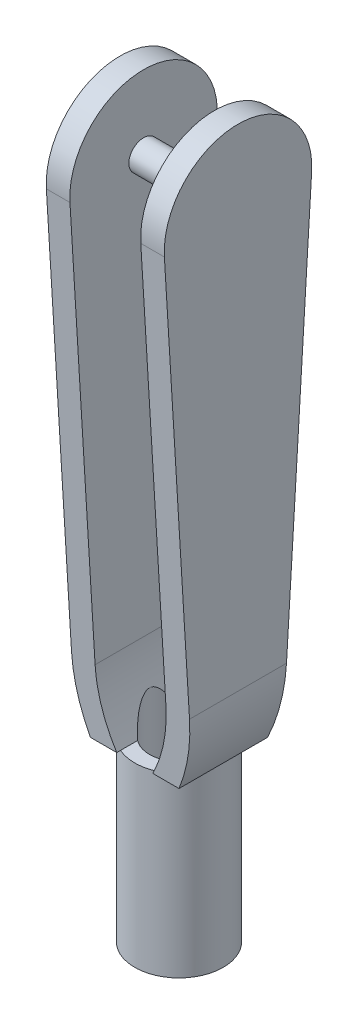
ISO-10303-21;
HEADER;
FILE_DESCRIPTION(('STEP AP214'),'2;1');
FILE_NAME('part.step','',(''),(''),'','','');
FILE_SCHEMA(('AUTOMOTIVE_DESIGN { 1 0 10303 214 1 1 1 1 }'));
ENDSEC;
DATA;
#1=APPLICATION_CONTEXT('core data for automotive mechanical design processes');
#2=APPLICATION_PROTOCOL_DEFINITION('international standard','automotive_design',2000,#1);
#3=PRODUCT_CONTEXT('',#1,'mechanical');
#4=PRODUCT('Part','Part','',(#3));
#5=PRODUCT_RELATED_PRODUCT_CATEGORY('part','',(#4));
#6=PRODUCT_DEFINITION_FORMATION('','',#4);
#7=PRODUCT_DEFINITION_CONTEXT('part definition',#1,'design');
#8=PRODUCT_DEFINITION('design','',#6,#7);
#9=PRODUCT_DEFINITION_SHAPE('','',#8);
#10=(LENGTH_UNIT() NAMED_UNIT(*) SI_UNIT(.MILLI.,.METRE.));
#11=(NAMED_UNIT(*) PLANE_ANGLE_UNIT() SI_UNIT($,.RADIAN.));
#12=(NAMED_UNIT(*) SI_UNIT($,.STERADIAN.) SOLID_ANGLE_UNIT());
#13=UNCERTAINTY_MEASURE_WITH_UNIT(LENGTH_MEASURE(1.E-05),#10,'distance_accuracy_value','');
#14=(GEOMETRIC_REPRESENTATION_CONTEXT(3) GLOBAL_UNCERTAINTY_ASSIGNED_CONTEXT((#13)) GLOBAL_UNIT_ASSIGNED_CONTEXT((#10,
#11,#12)) REPRESENTATION_CONTEXT('',''));
#15=CARTESIAN_POINT('',(0.,0.,0.));
#16=DIRECTION('',(0.,0.,1.));
#17=DIRECTION('',(1.,0.,0.));
#18=AXIS2_PLACEMENT_3D('',#15,#16,#17);
#19=CARTESIAN_POINT('',(0.,0.,3.));
#20=DIRECTION('',(0.,-1.,0.));
#21=DIRECTION('',(0.,0.,-1.));
#22=AXIS2_PLACEMENT_3D('',#19,#20,#21);
#23=PLANE('',#22);
#24=DIRECTION('',(0.,0.,1.));
#25=VECTOR('',#24,1.);
#26=CARTESIAN_POINT('',(0.610215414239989,0.,0.));
#27=LINE('',#26,#25);
#28=CARTESIAN_POINT('',(0.610215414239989,0.,3.7922355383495));
#29=VERTEX_POINT('',#28);
#30=CARTESIAN_POINT('',(0.61021541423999,0.,4.37026900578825));
#31=VERTEX_POINT('',#30);
#32=EDGE_CURVE('E306',#29,#31,#27,.T.);
#33=ORIENTED_EDGE('',*,*,#32,.F.);
#34=CARTESIAN_POINT('',(0.,0.,3.));
#35=DIRECTION('',(0.,-1.,0.));
#36=DIRECTION('',(0.,0.,-1.));
#37=AXIS2_PLACEMENT_3D('',#34,#35,#36);
#38=CIRCLE('',#37,1.);
#39=CARTESIAN_POINT('',(-0.610215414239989,0.,3.7922355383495));
#40=VERTEX_POINT('',#39);
#41=EDGE_CURVE('E167',#29,#40,#38,.T.);
#42=ORIENTED_EDGE('',*,*,#41,.T.);
#43=DIRECTION('',(0.,0.,1.));
#44=VECTOR('',#43,1.);
#45=CARTESIAN_POINT('',(-0.610215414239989,0.,0.));
#46=LINE('',#45,#44);
#47=CARTESIAN_POINT('',(-0.610215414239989,0.,4.37026900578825));
#48=VERTEX_POINT('',#47);
#49=EDGE_CURVE('E176',#40,#48,#46,.T.);
#50=ORIENTED_EDGE('',*,*,#49,.T.);
#51=CARTESIAN_POINT('',(0.,0.,3.));
#52=DIRECTION('',(0.,-1.,0.));
#53=DIRECTION('',(0.,0.,-1.));
#54=AXIS2_PLACEMENT_3D('',#51,#52,#53);
#55=CIRCLE('',#54,1.5);
#56=EDGE_CURVE('E540',#31,#48,#55,.T.);
#57=ORIENTED_EDGE('',*,*,#56,.F.);
#58=EDGE_LOOP('',(#33,#42,#50,#57));
#59=FACE_BOUND('',#58,.T.);
#60=ADVANCED_FACE('F36',(#59),#23,.F.);
#61=CARTESIAN_POINT('',(-1.5,0.,6.));
#62=DIRECTION('',(0.,1.,0.));
#63=DIRECTION('',(0.,0.,1.));
#64=AXIS2_PLACEMENT_3D('',#61,#62,#63);
#65=PLANE('',#64);
#66=CARTESIAN_POINT('',(0.610215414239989,0.,1.62973099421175));
#67=VERTEX_POINT('',#66);
#68=CARTESIAN_POINT('',(1.5,0.,3.));
#69=VERTEX_POINT('',#68);
#70=EDGE_CURVE('E307',#67,#69,#55,.T.);
#71=ORIENTED_EDGE('',*,*,#70,.F.);
#72=CARTESIAN_POINT('',(0.610215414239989,0.,1.5));
#73=VERTEX_POINT('',#72);
#74=EDGE_CURVE('E311',#73,#67,#27,.T.);
#75=ORIENTED_EDGE('',*,*,#74,.F.);
#76=DIRECTION('',(1.,0.,0.));
#77=VECTOR('',#76,1.);
#78=CARTESIAN_POINT('',(-2.,0.,1.5));
#79=LINE('',#78,#77);
#80=CARTESIAN_POINT('',(1.5,0.,1.5));
#81=VERTEX_POINT('',#80);
#82=EDGE_CURVE('E553',#73,#81,#79,.T.);
#83=ORIENTED_EDGE('',*,*,#82,.T.);
#84=DIRECTION('',(0.,0.,-1.));
#85=VECTOR('',#84,1.);
#86=CARTESIAN_POINT('',(1.5,0.,6.));
#87=LINE('',#86,#85);
#88=EDGE_CURVE('E504',#69,#81,#87,.T.);
#89=ORIENTED_EDGE('',*,*,#88,.F.);
#90=EDGE_LOOP('',(#71,#75,#83,#89));
#91=FACE_BOUND('',#90,.T.);
#92=ADVANCED_FACE('F38',(#91),#65,.F.);
#93=EDGE_CURVE('E47',#69,#31,#55,.T.);
#94=ORIENTED_EDGE('',*,*,#93,.F.);
#95=CARTESIAN_POINT('',(1.5,0.,4.5));
#96=VERTEX_POINT('',#95);
#97=EDGE_CURVE('E502',#96,#69,#87,.T.);
#98=ORIENTED_EDGE('',*,*,#97,.F.);
#99=DIRECTION('',(1.,0.,0.));
#100=VECTOR('',#99,1.);
#101=CARTESIAN_POINT('',(-2.,0.,4.5));
#102=LINE('',#101,#100);
#103=CARTESIAN_POINT('',(0.610215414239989,0.,4.5));
#104=VERTEX_POINT('',#103);
#105=EDGE_CURVE('E541',#104,#96,#102,.T.);
#106=ORIENTED_EDGE('',*,*,#105,.F.);
#107=EDGE_CURVE('E310',#31,#104,#27,.T.);
#108=ORIENTED_EDGE('',*,*,#107,.F.);
#109=EDGE_LOOP('',(#94,#98,#106,#108));
#110=FACE_BOUND('',#109,.T.);
#111=ADVANCED_FACE('F248',(#110),#65,.F.);
#112=CARTESIAN_POINT('',(-1.5,0.,6.));
#113=DIRECTION('',(0.,1.,0.));
#114=DIRECTION('',(0.,0.,1.));
#115=AXIS2_PLACEMENT_3D('',#112,#113,#114);
#116=PLANE('',#115);
#117=CARTESIAN_POINT('',(-1.5,0.,3.));
#118=VERTEX_POINT('',#117);
#119=EDGE_CURVE('E11',#48,#118,#55,.T.);
#120=ORIENTED_EDGE('',*,*,#119,.F.);
#121=CARTESIAN_POINT('',(-0.610215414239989,0.,4.5));
#122=VERTEX_POINT('',#121);
#123=EDGE_CURVE('E184',#48,#122,#46,.T.);
#124=ORIENTED_EDGE('',*,*,#123,.T.);
#125=DIRECTION('',(1.,0.,0.));
#126=VECTOR('',#125,1.);
#127=CARTESIAN_POINT('',(-2.,0.,4.5));
#128=LINE('',#127,#126);
#129=CARTESIAN_POINT('',(-1.5,0.,4.5));
#130=VERTEX_POINT('',#129);
#131=EDGE_CURVE('E321',#130,#122,#128,.T.);
#132=ORIENTED_EDGE('',*,*,#131,.F.);
#133=DIRECTION('',(0.,0.,-1.));
#134=VECTOR('',#133,1.);
#135=CARTESIAN_POINT('',(-1.5,0.,6.));
#136=LINE('',#135,#134);
#137=EDGE_CURVE('E203',#130,#118,#136,.T.);
#138=ORIENTED_EDGE('',*,*,#137,.T.);
#139=EDGE_LOOP('',(#120,#124,#132,#138));
#140=FACE_BOUND('',#139,.T.);
#141=ADVANCED_FACE('F279',(#140),#116,.F.);
#142=CARTESIAN_POINT('',(-0.610215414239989,0.,1.62973099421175));
#143=VERTEX_POINT('',#142);
#144=EDGE_CURVE('E45',#118,#143,#55,.T.);
#145=ORIENTED_EDGE('',*,*,#144,.F.);
#146=CARTESIAN_POINT('',(-1.5,0.,1.5));
#147=VERTEX_POINT('',#146);
#148=EDGE_CURVE('E185',#118,#147,#136,.T.);
#149=ORIENTED_EDGE('',*,*,#148,.T.);
#150=DIRECTION('',(1.,0.,0.));
#151=VECTOR('',#150,1.);
#152=CARTESIAN_POINT('',(-2.,0.,1.5));
#153=LINE('',#152,#151);
#154=CARTESIAN_POINT('',(-0.610215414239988,0.,1.5));
#155=VERTEX_POINT('',#154);
#156=EDGE_CURVE('E219',#147,#155,#153,.T.);
#157=ORIENTED_EDGE('',*,*,#156,.T.);
#158=EDGE_CURVE('E182',#155,#143,#46,.T.);
#159=ORIENTED_EDGE('',*,*,#158,.T.);
#160=EDGE_LOOP('',(#145,#149,#157,#159));
#161=FACE_BOUND('',#160,.T.);
#162=ADVANCED_FACE('F218',(#161),#116,.F.);
#163=CARTESIAN_POINT('',(1.2,2.35584379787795,0.));
#164=DIRECTION('',(1.,0.,0.));
#165=DIRECTION('',(0.,1.,0.));
#166=AXIS2_PLACEMENT_3D('',#163,#164,#165);
#167=PLANE('',#166);
#168=CARTESIAN_POINT('',(1.2,16.5,3.));
#169=DIRECTION('',(1.,0.,0.));
#170=DIRECTION('',(0.,1.,0.));
#171=AXIS2_PLACEMENT_3D('',#168,#169,#170);
#172=CIRCLE('',#171,2.5);
#173=CARTESIAN_POINT('',(1.2,16.3480647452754,5.49537886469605));
#174=VERTEX_POINT('',#173);
#175=CARTESIAN_POINT('',(1.2,16.3480647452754,0.504621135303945));
#176=VERTEX_POINT('',#175);
#177=EDGE_CURVE('E534',#174,#176,#172,.F.);
#178=ORIENTED_EDGE('',*,*,#177,.T.);
#179=DIRECTION('',(0.,-0.998151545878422,0.0607741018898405));
#180=VECTOR('',#179,1.);
#181=CARTESIAN_POINT('',(1.2,2.43813515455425,1.35155012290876));
#182=LINE('',#181,#180);
#183=CARTESIAN_POINT('',(1.2,2.35584379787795,1.35656056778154));
#184=VERTEX_POINT('',#183);
#185=EDGE_CURVE('E529',#176,#184,#182,.T.);
#186=ORIENTED_EDGE('',*,*,#185,.T.);
#187=DIRECTION('',(0.,0.,1.));
#188=VECTOR('',#187,1.);
#189=CARTESIAN_POINT('',(1.2,2.35584379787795,0.));
#190=LINE('',#189,#188);
#191=CARTESIAN_POINT('',(1.2,2.35584379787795,4.64343943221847));
#192=VERTEX_POINT('',#191);
#193=EDGE_CURVE('E522',#184,#192,#190,.T.);
#194=ORIENTED_EDGE('',*,*,#193,.T.);
#195=DIRECTION('',(0.,0.998151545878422,0.0607741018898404));
#196=VECTOR('',#195,1.);
#197=CARTESIAN_POINT('',(1.2,2.07416457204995,4.62628892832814));
#198=LINE('',#197,#196);
#199=EDGE_CURVE('E551',#192,#174,#198,.T.);
#200=ORIENTED_EDGE('',*,*,#199,.T.);
#201=EDGE_LOOP('',(#178,#186,#194,#200));
#202=FACE_BOUND('',#201,.T.);
#203=CARTESIAN_POINT('',(1.2,16.5,3.));
#204=DIRECTION('',(1.,0.,0.));
#205=DIRECTION('',(0.,1.,0.));
#206=AXIS2_PLACEMENT_3D('',#203,#204,#205);
#207=CIRCLE('',#206,0.500000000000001);
#208=CARTESIAN_POINT('',(1.2,17.,3.));
#209=VERTEX_POINT('',#208);
#210=EDGE_CURVE('E40',#209,#209,#207,.F.);
#211=ORIENTED_EDGE('',*,*,#210,.F.);
#212=EDGE_LOOP('',(#211));
#213=FACE_BOUND('',#212,.T.);
#214=ADVANCED_FACE('F342',(#202,#213),#167,.F.);
#215=CARTESIAN_POINT('',(-3.8,2.35584379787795,6.));
#216=DIRECTION('',(0.,0.,-1.));
#217=DIRECTION('',(-1.,0.,0.));
#218=AXIS2_PLACEMENT_3D('',#215,#216,#217);
#219=CYLINDRICAL_SURFACE('',#218,5.8);
#220=ORIENTED_EDGE('',*,*,#97,.T.);
#221=ORIENTED_EDGE('',*,*,#88,.T.);
#222=CARTESIAN_POINT('',(-3.8,2.35584379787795,1.35656056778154));
#223=DIRECTION('',(0.,0.0607741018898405,0.998151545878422));
#224=DIRECTION('',(0.,0.998151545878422,-0.0607741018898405));
#225=AXIS2_PLACEMENT_3D('',#222,#223,#224);
#226=ELLIPSE('',#225,5.81074088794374,5.8);
#227=CARTESIAN_POINT('',(2.,2.35584379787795,1.35656056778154));
#228=VERTEX_POINT('',#227);
#229=EDGE_CURVE('E526',#81,#228,#226,.T.);
#230=ORIENTED_EDGE('',*,*,#229,.T.);
#231=DIRECTION('',(0.,0.,-1.));
#232=VECTOR('',#231,1.);
#233=CARTESIAN_POINT('',(2.,2.35584379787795,6.));
#234=LINE('',#233,#232);
#235=CARTESIAN_POINT('',(2.,2.35584379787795,4.64343943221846));
#236=VERTEX_POINT('',#235);
#237=EDGE_CURVE('E519',#236,#228,#234,.T.);
#238=ORIENTED_EDGE('',*,*,#237,.F.);
#239=CARTESIAN_POINT('',(-3.8,2.35584379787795,4.64343943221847));
#240=DIRECTION('',(0.,0.0607741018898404,-0.998151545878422));
#241=DIRECTION('',(0.,-0.998151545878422,-0.0607741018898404));
#242=AXIS2_PLACEMENT_3D('',#239,#240,#241);
#243=ELLIPSE('',#242,5.81074088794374,5.8);
#244=EDGE_CURVE('E507',#236,#96,#243,.T.);
#245=ORIENTED_EDGE('',*,*,#244,.T.);
#246=EDGE_LOOP('',(#220,#221,#230,#238,#245));
#247=FACE_BOUND('',#246,.T.);
#248=ADVANCED_FACE('F399',(#247),#219,.T.);
#249=CARTESIAN_POINT('',(2.,2.35584379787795,6.));
#250=DIRECTION('',(-1.,0.,0.));
#251=DIRECTION('',(0.,0.,1.));
#252=AXIS2_PLACEMENT_3D('',#249,#250,#251);
#253=PLANE('',#252);
#254=ORIENTED_EDGE('',*,*,#237,.T.);
#255=DIRECTION('',(0.,-0.998151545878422,0.0607741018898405));
#256=VECTOR('',#255,1.);
#257=CARTESIAN_POINT('',(2.,0.,1.5));
#258=LINE('',#257,#256);
#259=CARTESIAN_POINT('',(2.,16.3480647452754,0.504621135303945));
#260=VERTEX_POINT('',#259);
#261=EDGE_CURVE('E543',#260,#228,#258,.T.);
#262=ORIENTED_EDGE('',*,*,#261,.F.);
#263=CARTESIAN_POINT('',(2.,16.5,3.));
#264=DIRECTION('',(-1.,0.,0.));
#265=DIRECTION('',(0.,0.,-1.));
#266=AXIS2_PLACEMENT_3D('',#263,#264,#265);
#267=CIRCLE('',#266,2.5);
#268=CARTESIAN_POINT('',(2.,16.3480647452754,5.49537886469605));
#269=VERTEX_POINT('',#268);
#270=EDGE_CURVE('E547',#269,#260,#267,.T.);
#271=ORIENTED_EDGE('',*,*,#270,.F.);
#272=DIRECTION('',(0.,0.998151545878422,0.0607741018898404));
#273=VECTOR('',#272,1.);
#274=CARTESIAN_POINT('',(2.,0.,4.5));
#275=LINE('',#274,#273);
#276=EDGE_CURVE('E560',#236,#269,#275,.T.);
#277=ORIENTED_EDGE('',*,*,#276,.F.);
#278=EDGE_LOOP('',(#254,#262,#271,#277));
#279=FACE_BOUND('',#278,.T.);
#280=ADVANCED_FACE('F437',(#279),#253,.F.);
#281=CARTESIAN_POINT('',(-3.8,2.35584379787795,0.));
#282=DIRECTION('',(0.,0.,1.));
#283=DIRECTION('',(1.,0.,0.));
#284=AXIS2_PLACEMENT_3D('',#281,#282,#283);
#285=CYLINDRICAL_SURFACE('',#284,5.);
#286=CARTESIAN_POINT('',(0.610215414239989,0.,2.2077644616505));
#287=VERTEX_POINT('',#286);
#288=EDGE_CURVE('E308',#67,#287,#27,.T.);
#289=ORIENTED_EDGE('',*,*,#288,.T.);
#290=CARTESIAN_POINT('',(0.610215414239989,0.,2.2077644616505));
#291=CARTESIAN_POINT('',(0.636707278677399,0.0495840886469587,2.22819975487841));
#292=CARTESIAN_POINT('',(0.662143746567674,0.0992239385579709,2.24988231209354));
#293=CARTESIAN_POINT('',(0.710955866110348,0.198453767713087,2.29595210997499));
#294=CARTESIAN_POINT('',(0.734325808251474,0.248043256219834,2.32034644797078));
#295=CARTESIAN_POINT('',(0.780078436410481,0.349322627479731,2.37329109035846));
#296=CARTESIAN_POINT('',(0.802345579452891,0.400986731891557,2.40199201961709));
#297=CARTESIAN_POINT('',(0.844389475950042,0.50309127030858,2.4629909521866));
#298=CARTESIAN_POINT('',(0.86416958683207,0.553533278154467,2.49528399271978));
#299=CARTESIAN_POINT('',(0.900802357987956,0.651403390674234,2.56403861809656));
#300=CARTESIAN_POINT('',(0.917697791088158,0.698867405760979,2.60042296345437));
#301=CARTESIAN_POINT('',(0.940611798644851,0.766138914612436,2.65987191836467));
#302=CARTESIAN_POINT('',(0.947810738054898,0.787796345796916,2.68037011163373));
#303=CARTESIAN_POINT('',(0.961276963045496,0.829177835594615,2.72348884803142));
#304=CARTESIAN_POINT('',(0.967546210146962,0.848905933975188,2.74610475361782));
#305=CARTESIAN_POINT('',(0.977044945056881,0.879358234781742,2.78631693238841));
#306=CARTESIAN_POINT('',(0.980602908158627,0.890935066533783,2.80318168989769));
#307=CARTESIAN_POINT('',(0.987005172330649,0.911994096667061,2.83832362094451));
#308=CARTESIAN_POINT('',(0.989849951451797,0.921477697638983,2.85659983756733));
#309=CARTESIAN_POINT('',(0.994233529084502,0.9362047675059,2.89156278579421));
#310=CARTESIAN_POINT('',(0.995907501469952,0.941880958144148,2.90804598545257));
#311=CARTESIAN_POINT('',(0.998445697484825,0.950518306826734,2.94176972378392));
#312=CARTESIAN_POINT('',(0.999311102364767,0.953483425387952,2.95900911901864));
#313=CARTESIAN_POINT('',(1.00013387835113,0.956301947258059,2.99387642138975));
#314=CARTESIAN_POINT('',(1.00008583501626,0.956136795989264,3.01150602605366));
#315=CARTESIAN_POINT('',(0.999074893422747,0.952674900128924,3.04642827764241));
#316=CARTESIAN_POINT('',(0.998111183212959,0.94937537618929,3.06372061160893));
#317=CARTESIAN_POINT('',(0.995091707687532,0.939112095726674,3.10106841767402));
#318=CARTESIAN_POINT('',(0.992847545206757,0.9315191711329,3.1209311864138));
#319=CARTESIAN_POINT('',(0.987442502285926,0.913455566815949,3.15916046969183));
#320=CARTESIAN_POINT('',(0.9842794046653,0.902977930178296,3.17752322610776));
#321=CARTESIAN_POINT('',(0.974359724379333,0.870596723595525,3.2273954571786));
#322=CARTESIAN_POINT('',(0.966793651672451,0.846406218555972,3.25722909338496));
#323=CARTESIAN_POINT('',(0.950100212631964,0.794657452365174,3.31331266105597));
#324=CARTESIAN_POINT('',(0.940966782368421,0.76708623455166,3.33954793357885));
#325=CARTESIAN_POINT('',(0.916261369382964,0.694818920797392,3.40268698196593));
#326=CARTESIAN_POINT('',(0.899858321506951,0.648850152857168,3.43779263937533));
#327=CARTESIAN_POINT('',(0.864634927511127,0.55480861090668,3.5037823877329));
#328=CARTESIAN_POINT('',(0.845809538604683,0.506731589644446,3.53465738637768));
#329=CARTESIAN_POINT('',(0.805897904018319,0.409444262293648,3.59311143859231));
#330=CARTESIAN_POINT('',(0.784808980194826,0.360232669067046,3.62068650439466));
#331=CARTESIAN_POINT('',(0.74045462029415,0.261275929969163,3.67297920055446));
#332=CARTESIAN_POINT('',(0.717188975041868,0.211530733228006,3.6976965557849));
#333=CARTESIAN_POINT('',(0.679675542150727,0.134715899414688,3.73373992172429));
#334=CARTESIAN_POINT('',(0.666186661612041,0.107711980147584,3.74600773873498));
#335=CARTESIAN_POINT('',(0.638639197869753,0.0538023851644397,3.76971964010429));
#336=CARTESIAN_POINT('',(0.624583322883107,0.0268967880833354,3.78116704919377));
#337=CARTESIAN_POINT('',(0.610215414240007,0.,3.79223553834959));
#338=B_SPLINE_CURVE_WITH_KNOTS('',3,(#290,#291,#292,#293,#294,#295,#296,#297,#298,#299,#300,
#301,#302,#303,#304,#305,#306,#307,#308,#309,#310,#311,#312,#313,#314,#315,#316,#317,#318,#319,
#320,#321,#322,#323,#324,#325,#326,#327,#328,#329,#330,#331,#332,#333,#334,#335,#336,#337),
.UNSPECIFIED.,.F.,.F.,(4,2,2,2,2,2,2,2,2,2,2,2,2,2,2,2,2,2,2,2,2,2,2,4),(0.,0.179432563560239,
0.359346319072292,0.548668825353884,0.73773294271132,0.923689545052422,1.01562732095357,
1.10736827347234,1.1695405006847,1.23167094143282,1.28400821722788,1.33626891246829,
1.38883947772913,1.44145670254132,1.50524375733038,1.5691860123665,1.68596896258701,
1.80321436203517,1.98316298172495,2.16349246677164,2.34403771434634,2.52460032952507,
2.62233632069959,2.71965075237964),.UNSPECIFIED.);
#339=EDGE_CURVE('E54',#287,#29,#338,.T.);
#340=ORIENTED_EDGE('',*,*,#339,.T.);
#341=ORIENTED_EDGE('',*,*,#32,.T.);
#342=ORIENTED_EDGE('',*,*,#107,.T.);
#343=CARTESIAN_POINT('',(-3.8,2.35584379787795,4.64343943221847));
#344=DIRECTION('',(0.,0.0607741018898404,-0.998151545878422));
#345=DIRECTION('',(0.,0.998151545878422,0.0607741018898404));
#346=AXIS2_PLACEMENT_3D('',#343,#344,#345);
#347=ELLIPSE('',#346,5.0092593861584,5.);
#348=EDGE_CURVE('E509',#104,#192,#347,.F.);
#349=ORIENTED_EDGE('',*,*,#348,.T.);
#350=ORIENTED_EDGE('',*,*,#193,.F.);
#351=CARTESIAN_POINT('',(-3.8,2.35584379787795,1.35656056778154));
#352=DIRECTION('',(0.,0.0607741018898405,0.998151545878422));
#353=DIRECTION('',(0.,-0.998151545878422,0.0607741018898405));
#354=AXIS2_PLACEMENT_3D('',#351,#352,#353);
#355=ELLIPSE('',#354,5.0092593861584,5.);
#356=EDGE_CURVE('E518',#184,#73,#355,.F.);
#357=ORIENTED_EDGE('',*,*,#356,.T.);
#358=ORIENTED_EDGE('',*,*,#74,.T.);
#359=EDGE_LOOP('',(#289,#340,#341,#342,#349,#350,#357,#358));
#360=FACE_BOUND('',#359,.T.);
#361=ADVANCED_FACE('F429',(#360),#285,.F.);
#362=CARTESIAN_POINT('',(-2.,16.5,3.));
#363=DIRECTION('',(1.,0.,0.));
#364=DIRECTION('',(0.,0.,-1.));
#365=AXIS2_PLACEMENT_3D('',#362,#363,#364);
#366=CYLINDRICAL_SURFACE('',#365,2.5);
#367=DIRECTION('',(1.,0.,0.));
#368=VECTOR('',#367,1.);
#369=CARTESIAN_POINT('',(-2.,16.3480647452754,5.49537886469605));
#370=LINE('',#369,#368);
#371=EDGE_CURVE('E542',#174,#269,#370,.T.);
#372=ORIENTED_EDGE('',*,*,#371,.T.);
#373=ORIENTED_EDGE('',*,*,#270,.T.);
#374=DIRECTION('',(1.,0.,0.));
#375=VECTOR('',#374,1.);
#376=CARTESIAN_POINT('',(-2.,16.3480647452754,0.504621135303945));
#377=LINE('',#376,#375);
#378=EDGE_CURVE('E545',#176,#260,#377,.T.);
#379=ORIENTED_EDGE('',*,*,#378,.F.);
#380=ORIENTED_EDGE('',*,*,#177,.F.);
#381=EDGE_LOOP('',(#372,#373,#379,#380));
#382=FACE_BOUND('',#381,.T.);
#383=ADVANCED_FACE('F419',(#382),#366,.T.);
#384=CARTESIAN_POINT('',(-2.,0.,1.5));
#385=DIRECTION('',(0.,0.0607741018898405,0.998151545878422));
#386=DIRECTION('',(0.,-0.998151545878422,0.0607741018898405));
#387=AXIS2_PLACEMENT_3D('',#384,#385,#386);
#388=PLANE('',#387);
#389=ORIENTED_EDGE('',*,*,#82,.F.);
#390=ORIENTED_EDGE('',*,*,#356,.F.);
#391=ORIENTED_EDGE('',*,*,#185,.F.);
#392=ORIENTED_EDGE('',*,*,#378,.T.);
#393=ORIENTED_EDGE('',*,*,#261,.T.);
#394=ORIENTED_EDGE('',*,*,#229,.F.);
#395=EDGE_LOOP('',(#389,#390,#391,#392,#393,#394));
#396=FACE_BOUND('',#395,.T.);
#397=ADVANCED_FACE('F409',(#396),#388,.F.);
#398=CARTESIAN_POINT('',(-2.,0.,4.5));
#399=DIRECTION('',(0.,0.0607741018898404,-0.998151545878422));
#400=DIRECTION('',(0.,0.998151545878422,0.0607741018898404));
#401=AXIS2_PLACEMENT_3D('',#398,#399,#400);
#402=PLANE('',#401);
#403=ORIENTED_EDGE('',*,*,#276,.T.);
#404=ORIENTED_EDGE('',*,*,#371,.F.);
#405=ORIENTED_EDGE('',*,*,#199,.F.);
#406=ORIENTED_EDGE('',*,*,#348,.F.);
#407=ORIENTED_EDGE('',*,*,#105,.T.);
#408=ORIENTED_EDGE('',*,*,#244,.F.);
#409=EDGE_LOOP('',(#403,#404,#405,#406,#407,#408));
#410=FACE_BOUND('',#409,.T.);
#411=ADVANCED_FACE('F389',(#410),#402,.F.);
#412=CARTESIAN_POINT('',(2.6142135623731,16.5,3.));
#413=DIRECTION('',(-1.,0.,0.));
#414=DIRECTION('',(0.,0.,1.));
#415=AXIS2_PLACEMENT_3D('',#412,#413,#414);
#416=CYLINDRICAL_SURFACE('',#415,0.500000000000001);
#417=CARTESIAN_POINT('',(-1.2,16.5,3.));
#418=DIRECTION('',(-1.,0.,0.));
#419=DIRECTION('',(0.,0.,1.));
#420=AXIS2_PLACEMENT_3D('',#417,#418,#419);
#421=CIRCLE('',#420,0.500000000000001);
#422=CARTESIAN_POINT('',(-1.2,16.5,3.5));
#423=VERTEX_POINT('',#422);
#424=EDGE_CURVE('E568',#423,#423,#421,.T.);
#425=ORIENTED_EDGE('',*,*,#424,.F.);
#426=EDGE_LOOP('',(#425));
#427=FACE_BOUND('',#426,.T.);
#428=ORIENTED_EDGE('',*,*,#210,.T.);
#429=EDGE_LOOP('',(#428));
#430=FACE_BOUND('',#429,.T.);
#431=ADVANCED_FACE('F238',(#427,#430),#416,.T.);
#432=CARTESIAN_POINT('',(-1.2,20.,0.));
#433=DIRECTION('',(-1.,0.,0.));
#434=DIRECTION('',(0.,0.,1.));
#435=AXIS2_PLACEMENT_3D('',#432,#433,#434);
#436=PLANE('',#435);
#437=DIRECTION('',(0.,0.,1.));
#438=VECTOR('',#437,1.);
#439=CARTESIAN_POINT('',(-1.2,2.35584379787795,0.));
#440=LINE('',#439,#438);
#441=CARTESIAN_POINT('',(-1.2,2.35584379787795,1.35656056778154));
#442=VERTEX_POINT('',#441);
#443=CARTESIAN_POINT('',(-1.2,2.35584379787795,4.64343943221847));
#444=VERTEX_POINT('',#443);
#445=EDGE_CURVE('E204',#442,#444,#440,.T.);
#446=ORIENTED_EDGE('',*,*,#445,.F.);
#447=DIRECTION('',(0.,0.998151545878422,-0.0607741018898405));
#448=VECTOR('',#447,1.);
#449=CARTESIAN_POINT('',(-1.2,20.0171228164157,0.281224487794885));
#450=LINE('',#449,#448);
#451=CARTESIAN_POINT('',(-1.2,16.3480647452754,0.504621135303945));
#452=VERTEX_POINT('',#451);
#453=EDGE_CURVE('E335',#442,#452,#450,.T.);
#454=ORIENTED_EDGE('',*,*,#453,.T.);
#455=CARTESIAN_POINT('',(-1.2,16.5,3.));
#456=DIRECTION('',(-1.,0.,0.));
#457=DIRECTION('',(0.,0.,1.));
#458=AXIS2_PLACEMENT_3D('',#455,#456,#457);
#459=CIRCLE('',#458,2.5);
#460=CARTESIAN_POINT('',(-1.2,16.3480647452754,5.49537886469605));
#461=VERTEX_POINT('',#460);
#462=EDGE_CURVE('E211',#452,#461,#459,.F.);
#463=ORIENTED_EDGE('',*,*,#462,.T.);
#464=DIRECTION('',(0.,-0.998151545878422,-0.0607741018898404));
#465=VECTOR('',#464,1.);
#466=CARTESIAN_POINT('',(-1.2,19.6531522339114,5.69661456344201));
#467=LINE('',#466,#465);
#468=EDGE_CURVE('E206',#461,#444,#467,.T.);
#469=ORIENTED_EDGE('',*,*,#468,.T.);
#470=EDGE_LOOP('',(#446,#454,#463,#469));
#471=FACE_BOUND('',#470,.T.);
#472=ORIENTED_EDGE('',*,*,#424,.T.);
#473=EDGE_LOOP('',(#472));
#474=FACE_BOUND('',#473,.T.);
#475=ADVANCED_FACE('F230',(#471,#474),#436,.F.);
#476=CARTESIAN_POINT('',(3.8,2.35584379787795,6.));
#477=DIRECTION('',(0.,0.,-1.));
#478=DIRECTION('',(-1.,0.,0.));
#479=AXIS2_PLACEMENT_3D('',#476,#477,#478);
#480=CYLINDRICAL_SURFACE('',#479,5.8);
#481=DIRECTION('',(0.,0.,-1.));
#482=VECTOR('',#481,1.);
#483=CARTESIAN_POINT('',(-2.,2.35584379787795,6.));
#484=LINE('',#483,#482);
#485=CARTESIAN_POINT('',(-2.,2.35584379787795,4.64343943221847));
#486=VERTEX_POINT('',#485);
#487=CARTESIAN_POINT('',(-2.,2.35584379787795,1.35656056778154));
#488=VERTEX_POINT('',#487);
#489=EDGE_CURVE('E188',#486,#488,#484,.T.);
#490=ORIENTED_EDGE('',*,*,#489,.T.);
#491=CARTESIAN_POINT('',(3.8,2.35584379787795,1.35656056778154));
#492=DIRECTION('',(0.,0.0607741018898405,0.998151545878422));
#493=DIRECTION('',(0.,0.998151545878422,-0.0607741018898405));
#494=AXIS2_PLACEMENT_3D('',#491,#492,#493);
#495=ELLIPSE('',#494,5.81074088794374,5.8);
#496=EDGE_CURVE('E194',#488,#147,#495,.T.);
#497=ORIENTED_EDGE('',*,*,#496,.T.);
#498=ORIENTED_EDGE('',*,*,#148,.F.);
#499=ORIENTED_EDGE('',*,*,#137,.F.);
#500=CARTESIAN_POINT('',(3.8,2.35584379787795,4.64343943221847));
#501=DIRECTION('',(0.,0.0607741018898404,-0.998151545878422));
#502=DIRECTION('',(0.,-0.998151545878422,-0.0607741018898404));
#503=AXIS2_PLACEMENT_3D('',#500,#501,#502);
#504=ELLIPSE('',#503,5.81074088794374,5.8);
#505=EDGE_CURVE('E330',#130,#486,#504,.T.);
#506=ORIENTED_EDGE('',*,*,#505,.T.);
#507=EDGE_LOOP('',(#490,#497,#498,#499,#506));
#508=FACE_BOUND('',#507,.T.);
#509=ADVANCED_FACE('F227',(#508),#480,.T.);
#510=CARTESIAN_POINT('',(-2.,2.35584379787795,6.));
#511=DIRECTION('',(1.,0.,0.));
#512=DIRECTION('',(0.,1.,0.));
#513=AXIS2_PLACEMENT_3D('',#510,#511,#512);
#514=PLANE('',#513);
#515=CARTESIAN_POINT('',(-2.,16.5,3.));
#516=DIRECTION('',(-1.,0.,0.));
#517=DIRECTION('',(0.,0.,-1.));
#518=AXIS2_PLACEMENT_3D('',#515,#516,#517);
#519=CIRCLE('',#518,2.5);
#520=CARTESIAN_POINT('',(-2.,16.3480647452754,5.49537886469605));
#521=VERTEX_POINT('',#520);
#522=CARTESIAN_POINT('',(-2.,16.3480647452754,0.504621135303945));
#523=VERTEX_POINT('',#522);
#524=EDGE_CURVE('E317',#521,#523,#519,.T.);
#525=ORIENTED_EDGE('',*,*,#524,.T.);
#526=DIRECTION('',(0.,-0.998151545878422,0.0607741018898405));
#527=VECTOR('',#526,1.);
#528=CARTESIAN_POINT('',(-2.,0.,1.5));
#529=LINE('',#528,#527);
#530=EDGE_CURVE('E320',#523,#488,#529,.T.);
#531=ORIENTED_EDGE('',*,*,#530,.T.);
#532=ORIENTED_EDGE('',*,*,#489,.F.);
#533=DIRECTION('',(0.,0.998151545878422,0.0607741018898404));
#534=VECTOR('',#533,1.);
#535=CARTESIAN_POINT('',(-2.,0.,4.5));
#536=LINE('',#535,#534);
#537=EDGE_CURVE('E314',#486,#521,#536,.T.);
#538=ORIENTED_EDGE('',*,*,#537,.T.);
#539=EDGE_LOOP('',(#525,#531,#532,#538));
#540=FACE_BOUND('',#539,.T.);
#541=ADVANCED_FACE('F229',(#540),#514,.F.);
#542=CARTESIAN_POINT('',(3.8,2.35584379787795,0.));
#543=DIRECTION('',(0.,0.,1.));
#544=DIRECTION('',(1.,0.,0.));
#545=AXIS2_PLACEMENT_3D('',#542,#543,#544);
#546=CYLINDRICAL_SURFACE('',#545,5.);
#547=ORIENTED_EDGE('',*,*,#49,.F.);
#548=CARTESIAN_POINT('',(-0.610215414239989,0.,3.7922355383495));
#549=CARTESIAN_POINT('',(-0.636707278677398,0.0495840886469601,3.77180024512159));
#550=CARTESIAN_POINT('',(-0.662143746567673,0.0992239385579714,3.75011768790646));
#551=CARTESIAN_POINT('',(-0.710955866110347,0.198453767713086,3.70404789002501));
#552=CARTESIAN_POINT('',(-0.734325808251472,0.248043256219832,3.67965355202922));
#553=CARTESIAN_POINT('',(-0.780078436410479,0.349322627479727,3.62670890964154));
#554=CARTESIAN_POINT('',(-0.802345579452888,0.400986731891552,3.59800798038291));
#555=CARTESIAN_POINT('',(-0.844389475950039,0.503091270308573,3.5370090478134));
#556=CARTESIAN_POINT('',(-0.864169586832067,0.553533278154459,3.50471600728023));
#557=CARTESIAN_POINT('',(-0.900802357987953,0.651403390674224,3.43596138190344));
#558=CARTESIAN_POINT('',(-0.917697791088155,0.698867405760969,3.39957703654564));
#559=CARTESIAN_POINT('',(-0.940611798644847,0.766138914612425,3.34012808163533));
#560=CARTESIAN_POINT('',(-0.947810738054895,0.787796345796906,3.31962988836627));
#561=CARTESIAN_POINT('',(-0.961276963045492,0.829177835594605,3.27651115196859));
#562=CARTESIAN_POINT('',(-0.967546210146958,0.848905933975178,3.25389524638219));
#563=CARTESIAN_POINT('',(-0.977044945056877,0.879358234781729,3.2136830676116));
#564=CARTESIAN_POINT('',(-0.980602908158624,0.890935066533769,3.19681831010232));
#565=CARTESIAN_POINT('',(-0.987005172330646,0.911994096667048,3.1616763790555));
#566=CARTESIAN_POINT('',(-0.989849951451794,0.921477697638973,3.14340016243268));
#567=CARTESIAN_POINT('',(-0.994233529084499,0.936204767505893,3.10843721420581));
#568=CARTESIAN_POINT('',(-0.995907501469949,0.941880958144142,3.09195401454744));
#569=CARTESIAN_POINT('',(-0.998445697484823,0.95051830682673,3.05823027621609));
#570=CARTESIAN_POINT('',(-0.999311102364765,0.95348342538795,3.04099088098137));
#571=CARTESIAN_POINT('',(-1.00013387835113,0.956301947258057,3.00612357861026));
#572=CARTESIAN_POINT('',(-1.00008583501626,0.956136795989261,2.98849397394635));
#573=CARTESIAN_POINT('',(-0.999074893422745,0.952674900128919,2.9535717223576));
#574=CARTESIAN_POINT('',(-0.998111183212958,0.949375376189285,2.93627938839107));
#575=CARTESIAN_POINT('',(-0.995091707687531,0.939112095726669,2.89893158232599));
#576=CARTESIAN_POINT('',(-0.992847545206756,0.931519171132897,2.87906881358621));
#577=CARTESIAN_POINT('',(-0.987442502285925,0.91345556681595,2.84083953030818));
#578=CARTESIAN_POINT('',(-0.9842794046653,0.902977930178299,2.82247677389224));
#579=CARTESIAN_POINT('',(-0.974359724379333,0.87059672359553,2.77260454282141));
#580=CARTESIAN_POINT('',(-0.966793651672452,0.846406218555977,2.74277090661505));
#581=CARTESIAN_POINT('',(-0.950100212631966,0.79465745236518,2.68668733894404));
#582=CARTESIAN_POINT('',(-0.940966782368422,0.767086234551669,2.66045206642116));
#583=CARTESIAN_POINT('',(-0.916261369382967,0.694818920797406,2.59731301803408));
#584=CARTESIAN_POINT('',(-0.899858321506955,0.648850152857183,2.56220736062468));
#585=CARTESIAN_POINT('',(-0.864634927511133,0.554808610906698,2.49621761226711));
#586=CARTESIAN_POINT('',(-0.845809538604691,0.506731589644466,2.46534261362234));
#587=CARTESIAN_POINT('',(-0.805897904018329,0.409444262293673,2.4068885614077));
#588=CARTESIAN_POINT('',(-0.784808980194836,0.360232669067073,2.37931349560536));
#589=CARTESIAN_POINT('',(-0.740454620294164,0.261275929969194,2.32702079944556));
#590=CARTESIAN_POINT('',(-0.717188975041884,0.211530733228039,2.30230344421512));
#591=CARTESIAN_POINT('',(-0.679675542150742,0.134715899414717,2.26626007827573));
#592=CARTESIAN_POINT('',(-0.666186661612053,0.107711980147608,2.25399226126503));
#593=CARTESIAN_POINT('',(-0.638639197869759,0.0538023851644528,2.23028035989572));
#594=CARTESIAN_POINT('',(-0.62458332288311,0.026896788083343,2.21883295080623));
#595=CARTESIAN_POINT('',(-0.610215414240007,0.,2.20776446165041));
#596=B_SPLINE_CURVE_WITH_KNOTS('',3,(#548,#549,#550,#551,#552,#553,#554,#555,#556,#557,#558,
#559,#560,#561,#562,#563,#564,#565,#566,#567,#568,#569,#570,#571,#572,#573,#574,#575,#576,#577,
#578,#579,#580,#581,#582,#583,#584,#585,#586,#587,#588,#589,#590,#591,#592,#593,#594,#595),
.UNSPECIFIED.,.F.,.F.,(4,2,2,2,2,2,2,2,2,2,2,2,2,2,2,2,2,2,2,2,2,2,2,4),(0.,0.179432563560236,
0.359346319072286,0.548668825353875,0.737732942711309,0.923689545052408,1.01562732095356,
1.10736827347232,1.16954050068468,1.2316709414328,1.28400821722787,1.33626891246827,
1.38883947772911,1.44145670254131,1.50524375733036,1.56918601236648,1.68596896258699,
1.80321436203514,1.98316298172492,2.1634924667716,2.3440377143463,2.52460032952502,
2.62233632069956,2.71965075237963),.UNSPECIFIED.);
#597=CARTESIAN_POINT('',(-0.610215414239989,0.,2.2077644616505));
#598=VERTEX_POINT('',#597);
#599=EDGE_CURVE('E159',#40,#598,#596,.T.);
#600=ORIENTED_EDGE('',*,*,#599,.T.);
#601=EDGE_CURVE('E173',#143,#598,#46,.T.);
#602=ORIENTED_EDGE('',*,*,#601,.F.);
#603=ORIENTED_EDGE('',*,*,#158,.F.);
#604=CARTESIAN_POINT('',(3.8,2.35584379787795,1.35656056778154));
#605=DIRECTION('',(0.,0.0607741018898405,0.998151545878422));
#606=DIRECTION('',(0.,-0.998151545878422,0.0607741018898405));
#607=AXIS2_PLACEMENT_3D('',#604,#605,#606);
#608=ELLIPSE('',#607,5.0092593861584,5.);
#609=EDGE_CURVE('E200',#155,#442,#608,.F.);
#610=ORIENTED_EDGE('',*,*,#609,.T.);
#611=ORIENTED_EDGE('',*,*,#445,.T.);
#612=CARTESIAN_POINT('',(3.8,2.35584379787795,4.64343943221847));
#613=DIRECTION('',(0.,0.0607741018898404,-0.998151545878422));
#614=DIRECTION('',(0.,0.998151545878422,0.0607741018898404));
#615=AXIS2_PLACEMENT_3D('',#612,#613,#614);
#616=ELLIPSE('',#615,5.0092593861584,5.);
#617=EDGE_CURVE('E224',#444,#122,#616,.F.);
#618=ORIENTED_EDGE('',*,*,#617,.T.);
#619=ORIENTED_EDGE('',*,*,#123,.F.);
#620=EDGE_LOOP('',(#547,#600,#602,#603,#610,#611,#618,#619));
#621=FACE_BOUND('',#620,.T.);
#622=ADVANCED_FACE('F171',(#621),#546,.F.);
#623=CARTESIAN_POINT('',(-2.,0.,1.5));
#624=DIRECTION('',(0.,0.0607741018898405,0.998151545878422));
#625=DIRECTION('',(0.,-0.998151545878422,0.0607741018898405));
#626=AXIS2_PLACEMENT_3D('',#623,#624,#625);
#627=PLANE('',#626);
#628=ORIENTED_EDGE('',*,*,#530,.F.);
#629=DIRECTION('',(1.,0.,0.));
#630=VECTOR('',#629,1.);
#631=CARTESIAN_POINT('',(-2.,16.3480647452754,0.504621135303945));
#632=LINE('',#631,#630);
#633=EDGE_CURVE('E225',#523,#452,#632,.T.);
#634=ORIENTED_EDGE('',*,*,#633,.T.);
#635=ORIENTED_EDGE('',*,*,#453,.F.);
#636=ORIENTED_EDGE('',*,*,#609,.F.);
#637=ORIENTED_EDGE('',*,*,#156,.F.);
#638=ORIENTED_EDGE('',*,*,#496,.F.);
#639=EDGE_LOOP('',(#628,#634,#635,#636,#637,#638));
#640=FACE_BOUND('',#639,.T.);
#641=ADVANCED_FACE('F222',(#640),#627,.F.);
#642=CARTESIAN_POINT('',(-2.,16.5,3.));
#643=DIRECTION('',(1.,0.,0.));
#644=DIRECTION('',(0.,0.,-1.));
#645=AXIS2_PLACEMENT_3D('',#642,#643,#644);
#646=CYLINDRICAL_SURFACE('',#645,2.5);
#647=ORIENTED_EDGE('',*,*,#633,.F.);
#648=ORIENTED_EDGE('',*,*,#524,.F.);
#649=DIRECTION('',(1.,0.,0.));
#650=VECTOR('',#649,1.);
#651=CARTESIAN_POINT('',(-2.,16.3480647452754,5.49537886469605));
#652=LINE('',#651,#650);
#653=EDGE_CURVE('E325',#521,#461,#652,.T.);
#654=ORIENTED_EDGE('',*,*,#653,.T.);
#655=ORIENTED_EDGE('',*,*,#462,.F.);
#656=EDGE_LOOP('',(#647,#648,#654,#655));
#657=FACE_BOUND('',#656,.T.);
#658=ADVANCED_FACE('F262',(#657),#646,.T.);
#659=CARTESIAN_POINT('',(-2.,0.,4.5));
#660=DIRECTION('',(0.,0.0607741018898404,-0.998151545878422));
#661=DIRECTION('',(0.,0.998151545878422,0.0607741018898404));
#662=AXIS2_PLACEMENT_3D('',#659,#660,#661);
#663=PLANE('',#662);
#664=ORIENTED_EDGE('',*,*,#131,.T.);
#665=ORIENTED_EDGE('',*,*,#617,.F.);
#666=ORIENTED_EDGE('',*,*,#468,.F.);
#667=ORIENTED_EDGE('',*,*,#653,.F.);
#668=ORIENTED_EDGE('',*,*,#537,.F.);
#669=ORIENTED_EDGE('',*,*,#505,.F.);
#670=EDGE_LOOP('',(#664,#665,#666,#667,#668,#669));
#671=FACE_BOUND('',#670,.T.);
#672=ADVANCED_FACE('F255',(#671),#663,.F.);
#673=ORIENTED_EDGE('',*,*,#601,.T.);
#674=EDGE_CURVE('E156',#598,#287,#38,.T.);
#675=ORIENTED_EDGE('',*,*,#674,.T.);
#676=ORIENTED_EDGE('',*,*,#288,.F.);
#677=EDGE_CURVE('E180',#143,#67,#55,.T.);
#678=ORIENTED_EDGE('',*,*,#677,.F.);
#679=EDGE_LOOP('',(#673,#675,#676,#678));
#680=FACE_BOUND('',#679,.T.);
#681=ADVANCED_FACE('F178',(#680),#23,.F.);
#682=CARTESIAN_POINT('',(0.,-6.,3.));
#683=DIRECTION('',(0.,1.,0.));
#684=DIRECTION('',(0.,0.,1.));
#685=AXIS2_PLACEMENT_3D('',#682,#683,#684);
#686=CYLINDRICAL_SURFACE('',#685,1.5);
#687=CARTESIAN_POINT('',(0.,-6.,3.));
#688=DIRECTION('',(0.,-1.,0.));
#689=DIRECTION('',(0.,0.,-1.));
#690=AXIS2_PLACEMENT_3D('',#687,#688,#689);
#691=CIRCLE('',#690,1.5);
#692=CARTESIAN_POINT('',(0.,-6.,1.5));
#693=VERTEX_POINT('',#692);
#694=EDGE_CURVE('E305',#693,#693,#691,.T.);
#695=ORIENTED_EDGE('',*,*,#694,.F.);
#696=EDGE_LOOP('',(#695));
#697=FACE_BOUND('',#696,.T.);
#698=ORIENTED_EDGE('',*,*,#70,.T.);
#699=ORIENTED_EDGE('',*,*,#93,.T.);
#700=ORIENTED_EDGE('',*,*,#56,.T.);
#701=ORIENTED_EDGE('',*,*,#119,.T.);
#702=ORIENTED_EDGE('',*,*,#144,.T.);
#703=ORIENTED_EDGE('',*,*,#677,.T.);
#704=EDGE_LOOP('',(#698,#699,#700,#701,#702,#703));
#705=FACE_BOUND('',#704,.T.);
#706=ADVANCED_FACE('F254',(#697,#705),#686,.T.);
#707=CARTESIAN_POINT('',(0.,-6.,3.));
#708=DIRECTION('',(0.,-1.,0.));
#709=DIRECTION('',(0.,0.,-1.));
#710=AXIS2_PLACEMENT_3D('',#707,#708,#709);
#711=PLANE('',#710);
#712=CARTESIAN_POINT('',(0.,-6.,3.));
#713=DIRECTION('',(0.,-1.,0.));
#714=DIRECTION('',(0.,0.,-1.));
#715=AXIS2_PLACEMENT_3D('',#712,#713,#714);
#716=CIRCLE('',#715,1.);
#717=CARTESIAN_POINT('',(0.,-6.,2.));
#718=VERTEX_POINT('',#717);
#719=EDGE_CURVE('E165',#718,#718,#716,.T.);
#720=ORIENTED_EDGE('',*,*,#719,.F.);
#721=EDGE_LOOP('',(#720));
#722=FACE_BOUND('',#721,.T.);
#723=ORIENTED_EDGE('',*,*,#694,.T.);
#724=EDGE_LOOP('',(#723));
#725=FACE_BOUND('',#724,.T.);
#726=ADVANCED_FACE('F260',(#722,#725),#711,.T.);
#727=CARTESIAN_POINT('',(0.,4.,3.));
#728=DIRECTION('',(0.,-1.,0.));
#729=DIRECTION('',(0.,0.,-1.));
#730=AXIS2_PLACEMENT_3D('',#727,#728,#729);
#731=CYLINDRICAL_SURFACE('',#730,1.);
#732=ORIENTED_EDGE('',*,*,#719,.T.);
#733=EDGE_LOOP('',(#732));
#734=FACE_BOUND('',#733,.T.);
#735=ORIENTED_EDGE('',*,*,#339,.F.);
#736=ORIENTED_EDGE('',*,*,#674,.F.);
#737=ORIENTED_EDGE('',*,*,#599,.F.);
#738=ORIENTED_EDGE('',*,*,#41,.F.);
#739=EDGE_LOOP('',(#735,#736,#737,#738));
#740=FACE_BOUND('',#739,.T.);
#741=ADVANCED_FACE('F158',(#734,#740),#731,.F.);
#742=CLOSED_SHELL('',(#60,#92,#111,#141,#162,#214,#248,#280,#361,#383,#397,#411,#431,#475,#509,
#541,#622,#641,#658,#672,#681,#706,#726,#741));
#743=MANIFOLD_SOLID_BREP('B2',#742);
#744=ADVANCED_BREP_SHAPE_REPRESENTATION('',(#18,#743),#14);
#745=SHAPE_DEFINITION_REPRESENTATION(#9,#744);
ENDSEC;
END-ISO-10303-21;
